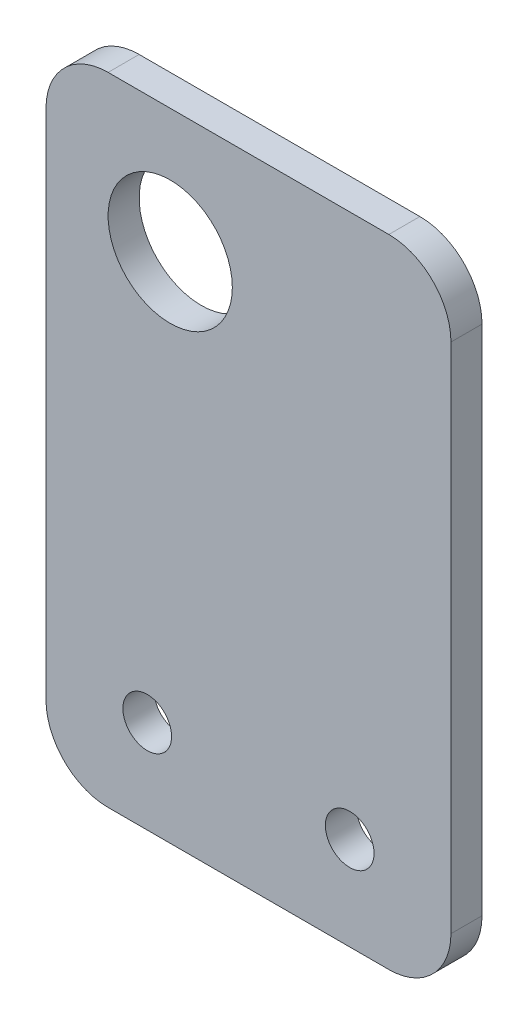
from build123d import *

# Parameters (mm, degrees)
SKETCH1_W           = 41.402
SKETCH1_H           = 65.0875
SKETCH1_R           = 6.35
SKETCH1_R_2         = 2.4892
BOSS_EXTRUDE1_DEPTH = 3.175
FILLET1_R           = 6.35


with BuildPart() as part:
    # Sketch1 → Boss-Extrude1 (new body)
    with BuildSketch(Plane.XY):
        with Locations((8.001, -19.84375)):
            Rectangle(SKETCH1_W, SKETCH1_H)
        Circle(SKETCH1_R, mode=Mode.SUBTRACT)
        with Locations((-2.3495, -42.8625)):
            Circle(SKETCH1_R_2, mode=Mode.SUBTRACT)
        with Locations((18.3515, -42.8625)):
            Circle(SKETCH1_R_2, mode=Mode.SUBTRACT)
    extrude(amount=BOSS_EXTRUDE1_DEPTH)

    # Fillet1
    fillet1_edges = [part.edges().sort_by_distance(p)[0] for p in [
        (28.702, 12.7, 1.5875),
        (28.702, -52.3875, 1.5875),
        (-12.7, -52.3875, 1.5875),
        (-12.7, 12.7, 1.5875),
    ]]
    fillet(fillet1_edges, radius=FILLET1_R)


solid = part.part
